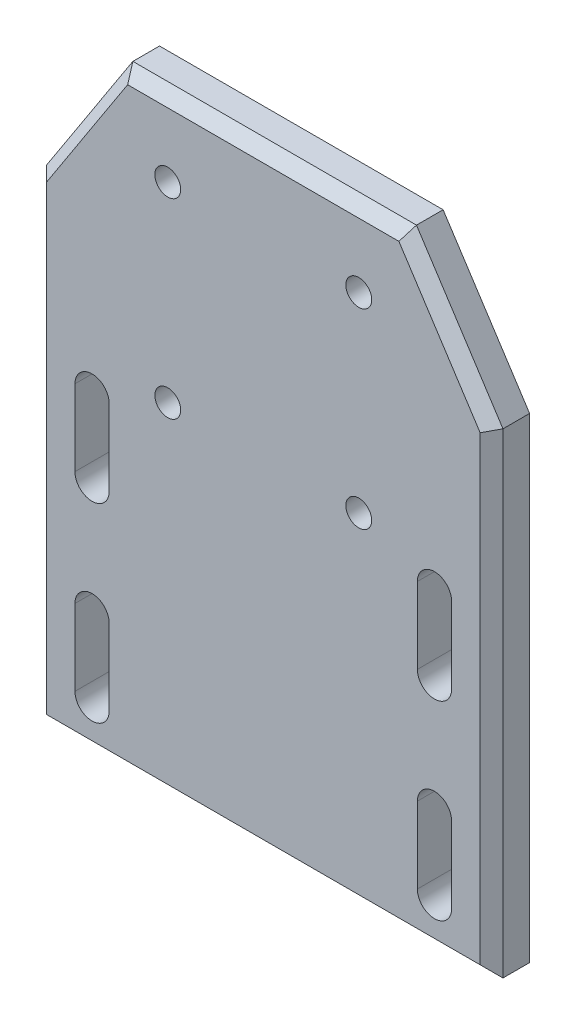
from build123d import *

# Parameters (mm, degrees)
EXTRUSION1_DEPTH      = 10
TROU_TARAUD_M82_D     = 6.8
TROU_TARAUD_M82_DEPTH = 22.25
TROU_TARAUD_M82_TIP   = 2.042926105
CHANFREIN1_SIZE       = 3


with BuildPart() as part:
    # Esquisse1 → Extrusion1 (new body)
    with BuildSketch(Plane.XY):
        Polygon((-60, -115), (60, -115), (60, 10), (37.270734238, 45), (-37.270734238, 45), (-60, 10), align=None)
        with BuildLine():
            Line((-40.5, -83), (-40.5, -103))
            ThreePointArc((-40.5, -103), (-45, -107.5), (-49.5, -103))
            Line((-49.5, -103), (-49.5, -83))
            ThreePointArc((-49.5, -83), (-45, -78.5), (-40.5, -83))
        make_face(mode=Mode.SUBTRACT)
        with BuildLine():
            Line((-49.5, -53), (-49.5, -33))
            ThreePointArc((-49.5, -33), (-45, -28.5), (-40.5, -33))
            Line((-40.5, -33), (-40.5, -53))
            ThreePointArc((-40.5, -53), (-45, -57.5), (-49.5, -53))
        make_face(mode=Mode.SUBTRACT)
        with BuildLine():
            Line((49.5, -83), (49.5, -103))
            ThreePointArc((49.5, -103), (45, -107.5), (40.5, -103))
            Line((40.5, -103), (40.5, -83))
            ThreePointArc((40.5, -83), (45, -78.5), (49.5, -83))
        make_face(mode=Mode.SUBTRACT)
        with BuildLine():
            Line((40.5, -53), (40.5, -33))
            ThreePointArc((40.5, -33), (45, -28.5), (49.5, -33))
            Line((49.5, -33), (49.5, -53))
            ThreePointArc((49.5, -53), (45, -57.5), (40.5, -53))
        make_face(mode=Mode.SUBTRACT)
    extrude(amount=EXTRUSION1_DEPTH)

    # Trou taraud_ M82
    with Locations(Plane.XY.offset(10)):
        with Locations((-25.102290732, 25.102290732), (25.102290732, 25.102290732), (25.102290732, -25.102290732), (-25.102290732, -25.102290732)):
            Hole(TROU_TARAUD_M82_D / 2, depth=TROU_TARAUD_M82_DEPTH)
            with Locations((0, 0, -(TROU_TARAUD_M82_DEPTH + TROU_TARAUD_M82_TIP / 2))):  # 118° drill point
                Cone(0, TROU_TARAUD_M82_D / 2, TROU_TARAUD_M82_TIP, mode=Mode.SUBTRACT)

    # Chanfrein1
    chanfrein1_edges = [part.edges().sort_by_distance(p)[0] for p in [
        (60, -52.5, 10),
        (48.635367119, 27.5, 10),
        (0, 45, 10),
        (-48.635367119, 27.5, 10),
        (-60, -52.5, 10),
        (0, -115, 10),
    ]]
    chamfer(chanfrein1_edges, length=CHANFREIN1_SIZE)


solid = part.part
